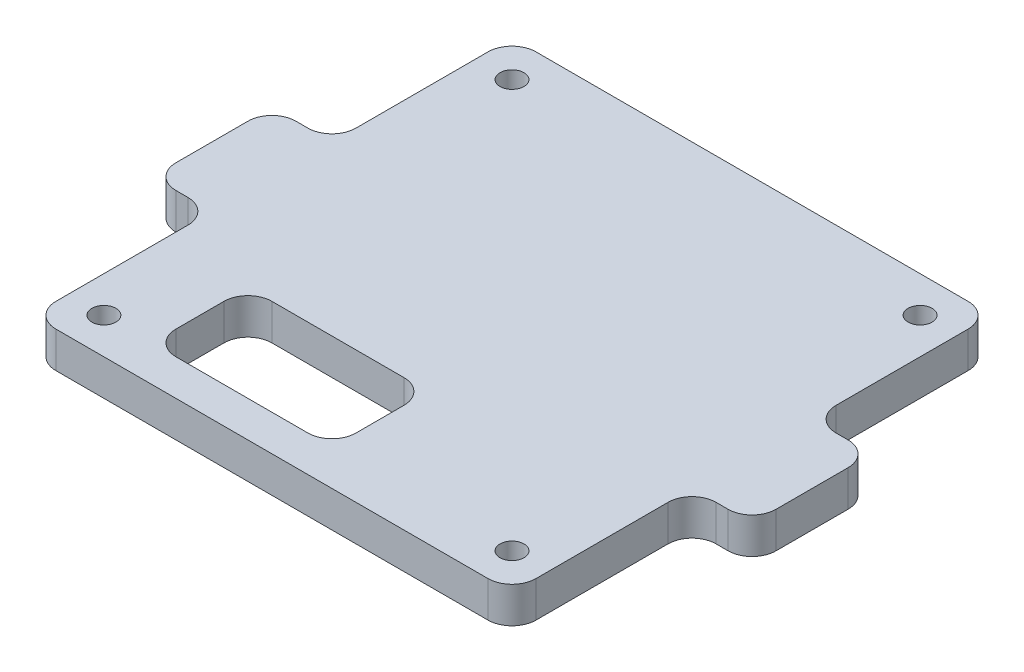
from build123d import *

# Parameters (mm, degrees)
SKETCH1_R           = 1
SKETCH1_W           = 15
SKETCH1_H           = 8
BOSS_EXTRUDE1_DEPTH = 3
FILLET1_R           = 2


with BuildPart() as part:
    # Sketch1 → Boss-Extrude1 (new body)
    with BuildSketch(Plane(origin=(0, 0, 0), x_dir=(1, 0, 0), z_dir=(0, 1, 0))):
        Polygon((20, -20), (-20, -20), (-20, -5), (-25, -5), (-25, 5), (-20, 5), (-20, 20), (20, 20), (20, 5), (25, 5), (25, -5), (20, -5), align=None)
        with Locations(Location((-17, 17, 0), (0, 0, 270))):
            Circle(SKETCH1_R, mode=Mode.SUBTRACT)
        with Locations(Location((17, 17, 0), (0, 0, 90))):
            Circle(SKETCH1_R, mode=Mode.SUBTRACT)
        with Locations(Location((-17, -17, 0), (0, 0, 90))):
            Circle(SKETCH1_R, mode=Mode.SUBTRACT)
        with Locations(Location((17, -17, 0), (0, 0, 270))):
            Circle(SKETCH1_R, mode=Mode.SUBTRACT)
        with Locations((-5.5, -13)):
            Rectangle(SKETCH1_W, SKETCH1_H, mode=Mode.SUBTRACT)
    extrude(amount=BOSS_EXTRUDE1_DEPTH)

    # Fillet1
    fillet1_edges = [part.edges().sort_by_distance(p)[0] for p in [
        (-20, 1.5, -20),
        (20, 1.5, -20),
        (20, 1.5, -5),
        (25, 1.5, -5),
        (25, 1.5, 5),
        (20, 1.5, 5),
        (20, 1.5, 20),
        (-20, 1.5, 20),
        (-20, 1.5, 5),
        (-25, 1.5, 5),
        (-25, 1.5, -5),
        (-20, 1.5, -5),
        (-13, 1.5, 9),
        (-13, 1.5, 17),
        (2, 1.5, 17),
        (2, 1.5, 9),
    ]]
    fillet(fillet1_edges, radius=FILLET1_R)


solid = part.part
